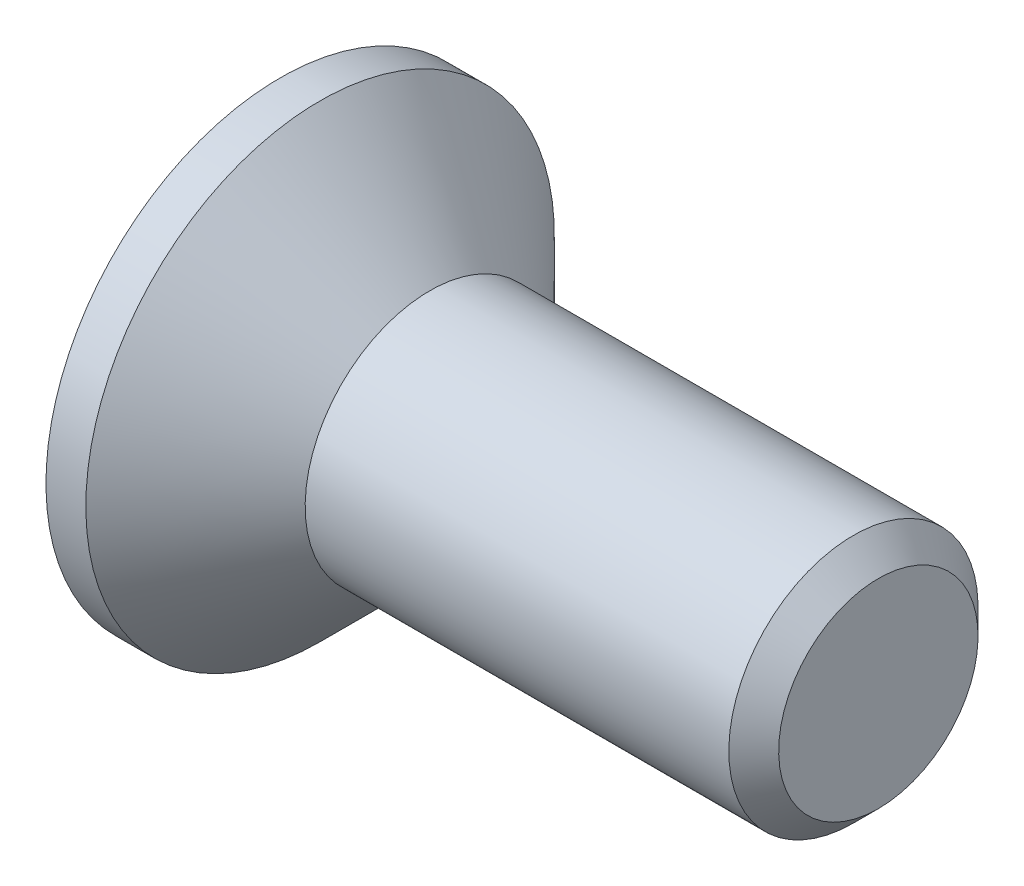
ISO-10303-21;
HEADER;
FILE_DESCRIPTION(('STEP AP214'),'2;1');
FILE_NAME('part.step','',(''),(''),'','','');
FILE_SCHEMA(('AUTOMOTIVE_DESIGN { 1 0 10303 214 1 1 1 1 }'));
ENDSEC;
DATA;
#1=APPLICATION_CONTEXT('core data for automotive mechanical design processes');
#2=APPLICATION_PROTOCOL_DEFINITION('international standard','automotive_design',2000,#1);
#3=PRODUCT_CONTEXT('',#1,'mechanical');
#4=PRODUCT('Part','Part','',(#3));
#5=PRODUCT_RELATED_PRODUCT_CATEGORY('part','',(#4));
#6=PRODUCT_DEFINITION_FORMATION('','',#4);
#7=PRODUCT_DEFINITION_CONTEXT('part definition',#1,'design');
#8=PRODUCT_DEFINITION('design','',#6,#7);
#9=PRODUCT_DEFINITION_SHAPE('','',#8);
#10=(LENGTH_UNIT() NAMED_UNIT(*) SI_UNIT(.MILLI.,.METRE.));
#11=(NAMED_UNIT(*) PLANE_ANGLE_UNIT() SI_UNIT($,.RADIAN.));
#12=(NAMED_UNIT(*) SI_UNIT($,.STERADIAN.) SOLID_ANGLE_UNIT());
#13=UNCERTAINTY_MEASURE_WITH_UNIT(LENGTH_MEASURE(1.E-05),#10,'distance_accuracy_value','');
#14=(GEOMETRIC_REPRESENTATION_CONTEXT(3) GLOBAL_UNCERTAINTY_ASSIGNED_CONTEXT((#13)) GLOBAL_UNIT_ASSIGNED_CONTEXT((#10,
#11,#12)) REPRESENTATION_CONTEXT('',''));
#15=CARTESIAN_POINT('',(0.,0.,0.));
#16=DIRECTION('',(0.,0.,1.));
#17=DIRECTION('',(1.,0.,0.));
#18=AXIS2_PLACEMENT_3D('',#15,#16,#17);
#19=CARTESIAN_POINT('',(0.,0.,0.));
#20=DIRECTION('',(-1.,0.,0.));
#21=DIRECTION('',(0.,-1.,0.));
#22=AXIS2_PLACEMENT_3D('',#19,#20,#21);
#23=CONICAL_SURFACE('',#22,1.25,0.78539816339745);
#24=CARTESIAN_POINT('',(-1.1,0.,0.));
#25=DIRECTION('',(-1.,0.,0.));
#26=DIRECTION('',(0.,-1.,0.));
#27=AXIS2_PLACEMENT_3D('',#24,#25,#26);
#28=CIRCLE('',#27,2.35);
#29=CARTESIAN_POINT('',(-1.1,-2.35,0.));
#30=VERTEX_POINT('',#29);
#31=EDGE_CURVE('E189',#30,#30,#28,.T.);
#32=ORIENTED_EDGE('',*,*,#31,.F.);
#33=EDGE_LOOP('',(#32));
#34=FACE_BOUND('',#33,.T.);
#35=CARTESIAN_POINT('',(0.,0.,0.));
#36=DIRECTION('',(-1.,0.,0.));
#37=DIRECTION('',(0.,-1.,0.));
#38=AXIS2_PLACEMENT_3D('',#35,#36,#37);
#39=CIRCLE('',#38,1.25);
#40=CARTESIAN_POINT('',(0.,-1.25,0.));
#41=VERTEX_POINT('',#40);
#42=EDGE_CURVE('E212',#41,#41,#39,.T.);
#43=ORIENTED_EDGE('',*,*,#42,.T.);
#44=EDGE_LOOP('',(#43));
#45=FACE_BOUND('',#44,.T.);
#46=ADVANCED_FACE('F33',(#34,#45),#23,.T.);
#47=CARTESIAN_POINT('',(-1.5,0.,0.));
#48=DIRECTION('',(-1.,0.,0.));
#49=DIRECTION('',(0.,-1.,0.));
#50=AXIS2_PLACEMENT_3D('',#47,#48,#49);
#51=CYLINDRICAL_SURFACE('',#50,1.25);
#52=CARTESIAN_POINT('',(4.25,0.,0.));
#53=DIRECTION('',(-1.,0.,0.));
#54=DIRECTION('',(0.,-1.,0.));
#55=AXIS2_PLACEMENT_3D('',#52,#53,#54);
#56=CIRCLE('',#55,1.25);
#57=CARTESIAN_POINT('',(4.25,-1.25,0.));
#58=VERTEX_POINT('',#57);
#59=EDGE_CURVE('E41',#58,#58,#56,.T.);
#60=ORIENTED_EDGE('',*,*,#59,.T.);
#61=EDGE_LOOP('',(#60));
#62=FACE_BOUND('',#61,.T.);
#63=ORIENTED_EDGE('',*,*,#42,.F.);
#64=EDGE_LOOP('',(#63));
#65=FACE_BOUND('',#64,.T.);
#66=ADVANCED_FACE('F217',(#62,#65),#51,.T.);
#67=CARTESIAN_POINT('',(4.5,0.,0.));
#68=DIRECTION('',(-1.,0.,0.));
#69=DIRECTION('',(0.,-1.,0.));
#70=AXIS2_PLACEMENT_3D('',#67,#68,#69);
#71=PLANE('',#70);
#72=CARTESIAN_POINT('',(4.5,0.,0.));
#73=DIRECTION('',(-1.,0.,0.));
#74=DIRECTION('',(0.,-1.,0.));
#75=AXIS2_PLACEMENT_3D('',#72,#73,#74);
#76=CIRCLE('',#75,0.999999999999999);
#77=CARTESIAN_POINT('',(4.5,-0.999999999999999,0.));
#78=VERTEX_POINT('',#77);
#79=EDGE_CURVE('E11',#78,#78,#76,.F.);
#80=ORIENTED_EDGE('',*,*,#79,.T.);
#81=EDGE_LOOP('',(#80));
#82=FACE_BOUND('',#81,.T.);
#83=ADVANCED_FACE('F239',(#82),#71,.F.);
#84=CARTESIAN_POINT('',(-1.5,2.35,0.));
#85=DIRECTION('',(1.,0.,0.));
#86=DIRECTION('',(0.,1.,0.));
#87=AXIS2_PLACEMENT_3D('',#84,#85,#86);
#88=PLANE('',#87);
#89=DIRECTION('',(0.,0.,-1.));
#90=VECTOR('',#89,1.);
#91=CARTESIAN_POINT('',(-1.5,0.34,-1.35));
#92=LINE('',#91,#90);
#93=CARTESIAN_POINT('',(-1.5,0.34,-0.34));
#94=VERTEX_POINT('',#93);
#95=CARTESIAN_POINT('',(-1.5,0.34,-1.35));
#96=VERTEX_POINT('',#95);
#97=EDGE_CURVE('E158',#94,#96,#92,.T.);
#98=ORIENTED_EDGE('',*,*,#97,.F.);
#99=DIRECTION('',(0.,-1.,0.));
#100=VECTOR('',#99,1.);
#101=CARTESIAN_POINT('',(-1.5,0.34,-0.34));
#102=LINE('',#101,#100);
#103=CARTESIAN_POINT('',(-1.5,1.35,-0.34));
#104=VERTEX_POINT('',#103);
#105=EDGE_CURVE('E48',#104,#94,#102,.T.);
#106=ORIENTED_EDGE('',*,*,#105,.F.);
#107=DIRECTION('',(0.,0.,-1.));
#108=VECTOR('',#107,1.);
#109=CARTESIAN_POINT('',(-1.5,1.35,-0.34));
#110=LINE('',#109,#108);
#111=CARTESIAN_POINT('',(-1.5,1.35,0.34));
#112=VERTEX_POINT('',#111);
#113=EDGE_CURVE('E185',#112,#104,#110,.T.);
#114=ORIENTED_EDGE('',*,*,#113,.F.);
#115=DIRECTION('',(0.,1.,0.));
#116=VECTOR('',#115,1.);
#117=CARTESIAN_POINT('',(-1.5,1.35,0.34));
#118=LINE('',#117,#116);
#119=CARTESIAN_POINT('',(-1.5,0.34,0.34));
#120=VERTEX_POINT('',#119);
#121=EDGE_CURVE('E183',#120,#112,#118,.T.);
#122=ORIENTED_EDGE('',*,*,#121,.F.);
#123=DIRECTION('',(0.,0.,-1.));
#124=VECTOR('',#123,1.);
#125=CARTESIAN_POINT('',(-1.5,0.34,0.34));
#126=LINE('',#125,#124);
#127=CARTESIAN_POINT('',(-1.5,0.34,1.35));
#128=VERTEX_POINT('',#127);
#129=EDGE_CURVE('E132',#128,#120,#126,.T.);
#130=ORIENTED_EDGE('',*,*,#129,.F.);
#131=DIRECTION('',(0.,1.,0.));
#132=VECTOR('',#131,1.);
#133=CARTESIAN_POINT('',(-1.5,0.34,1.35));
#134=LINE('',#133,#132);
#135=CARTESIAN_POINT('',(-1.5,-0.34,1.35));
#136=VERTEX_POINT('',#135);
#137=EDGE_CURVE('E179',#136,#128,#134,.T.);
#138=ORIENTED_EDGE('',*,*,#137,.F.);
#139=DIRECTION('',(0.,0.,1.));
#140=VECTOR('',#139,1.);
#141=CARTESIAN_POINT('',(-1.5,-0.34,1.35));
#142=LINE('',#141,#140);
#143=CARTESIAN_POINT('',(-1.5,-0.34,0.34));
#144=VERTEX_POINT('',#143);
#145=EDGE_CURVE('E176',#144,#136,#142,.T.);
#146=ORIENTED_EDGE('',*,*,#145,.F.);
#147=DIRECTION('',(0.,1.,0.));
#148=VECTOR('',#147,1.);
#149=CARTESIAN_POINT('',(-1.5,-0.34,0.34));
#150=LINE('',#149,#148);
#151=CARTESIAN_POINT('',(-1.5,-1.35,0.34));
#152=VERTEX_POINT('',#151);
#153=EDGE_CURVE('E173',#152,#144,#150,.T.);
#154=ORIENTED_EDGE('',*,*,#153,.F.);
#155=DIRECTION('',(0.,0.,1.));
#156=VECTOR('',#155,1.);
#157=CARTESIAN_POINT('',(-1.5,-1.35,0.34));
#158=LINE('',#157,#156);
#159=CARTESIAN_POINT('',(-1.5,-1.35,-0.34));
#160=VERTEX_POINT('',#159);
#161=EDGE_CURVE('E170',#160,#152,#158,.T.);
#162=ORIENTED_EDGE('',*,*,#161,.F.);
#163=DIRECTION('',(0.,-1.,0.));
#164=VECTOR('',#163,1.);
#165=CARTESIAN_POINT('',(-1.5,-1.35,-0.34));
#166=LINE('',#165,#164);
#167=CARTESIAN_POINT('',(-1.5,-0.34,-0.34));
#168=VERTEX_POINT('',#167);
#169=EDGE_CURVE('E167',#168,#160,#166,.T.);
#170=ORIENTED_EDGE('',*,*,#169,.F.);
#171=DIRECTION('',(0.,0.,1.));
#172=VECTOR('',#171,1.);
#173=CARTESIAN_POINT('',(-1.5,-0.34,-0.34));
#174=LINE('',#173,#172);
#175=CARTESIAN_POINT('',(-1.5,-0.34,-1.35));
#176=VERTEX_POINT('',#175);
#177=EDGE_CURVE('E164',#176,#168,#174,.T.);
#178=ORIENTED_EDGE('',*,*,#177,.F.);
#179=DIRECTION('',(0.,-1.,0.));
#180=VECTOR('',#179,1.);
#181=CARTESIAN_POINT('',(-1.5,-0.34,-1.35));
#182=LINE('',#181,#180);
#183=EDGE_CURVE('E161',#96,#176,#182,.T.);
#184=ORIENTED_EDGE('',*,*,#183,.F.);
#185=EDGE_LOOP('',(#98,#106,#114,#122,#130,#138,#146,#154,#162,#170,#178,#184));
#186=FACE_BOUND('',#185,.T.);
#187=CARTESIAN_POINT('',(-1.5,0.,0.));
#188=DIRECTION('',(-1.,0.,0.));
#189=DIRECTION('',(0.,-1.,0.));
#190=AXIS2_PLACEMENT_3D('',#187,#188,#189);
#191=CIRCLE('',#190,2.35);
#192=CARTESIAN_POINT('',(-1.5,-2.35,0.));
#193=VERTEX_POINT('',#192);
#194=EDGE_CURVE('E209',#193,#193,#191,.T.);
#195=ORIENTED_EDGE('',*,*,#194,.T.);
#196=EDGE_LOOP('',(#195));
#197=FACE_BOUND('',#196,.T.);
#198=ADVANCED_FACE('F230',(#186,#197),#88,.F.);
#199=CARTESIAN_POINT('',(-1.5,0.,0.));
#200=DIRECTION('',(-1.,0.,0.));
#201=DIRECTION('',(0.,-1.,0.));
#202=AXIS2_PLACEMENT_3D('',#199,#200,#201);
#203=CYLINDRICAL_SURFACE('',#202,2.35);
#204=ORIENTED_EDGE('',*,*,#194,.F.);
#205=EDGE_LOOP('',(#204));
#206=FACE_BOUND('',#205,.T.);
#207=ORIENTED_EDGE('',*,*,#31,.T.);
#208=EDGE_LOOP('',(#207));
#209=FACE_BOUND('',#208,.T.);
#210=ADVANCED_FACE('F222',(#206,#209),#203,.T.);
#211=CARTESIAN_POINT('',(4.25,0.,0.));
#212=DIRECTION('',(-1.,0.,0.));
#213=DIRECTION('',(0.,-1.,0.));
#214=AXIS2_PLACEMENT_3D('',#211,#212,#213);
#215=CONICAL_SURFACE('',#214,1.25,0.785398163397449);
#216=ORIENTED_EDGE('',*,*,#79,.F.);
#217=EDGE_LOOP('',(#216));
#218=FACE_BOUND('',#217,.T.);
#219=ORIENTED_EDGE('',*,*,#59,.F.);
#220=EDGE_LOOP('',(#219));
#221=FACE_BOUND('',#220,.T.);
#222=ADVANCED_FACE('F35',(#218,#221),#215,.T.);
#223=CARTESIAN_POINT('',(-0.25,0.34,-0.34));
#224=DIRECTION('',(0.,0.,-1.));
#225=DIRECTION('',(-1.,0.,0.));
#226=AXIS2_PLACEMENT_3D('',#223,#224,#225);
#227=PLANE('',#226);
#228=ORIENTED_EDGE('',*,*,#105,.T.);
#229=DIRECTION('',(-1.,0.,0.));
#230=VECTOR('',#229,1.);
#231=CARTESIAN_POINT('',(-0.25,0.34,-0.34));
#232=LINE('',#231,#230);
#233=CARTESIAN_POINT('',(-0.25,0.34,-0.34));
#234=VERTEX_POINT('',#233);
#235=EDGE_CURVE('E96',#234,#94,#232,.T.);
#236=ORIENTED_EDGE('',*,*,#235,.F.);
#237=DIRECTION('',(0.,-1.,0.));
#238=VECTOR('',#237,1.);
#239=CARTESIAN_POINT('',(-0.25,0.34,-0.34));
#240=LINE('',#239,#238);
#241=CARTESIAN_POINT('',(-0.25,1.35,-0.34));
#242=VERTEX_POINT('',#241);
#243=EDGE_CURVE('E187',#242,#234,#240,.T.);
#244=ORIENTED_EDGE('',*,*,#243,.F.);
#245=DIRECTION('',(-1.,0.,0.));
#246=VECTOR('',#245,1.);
#247=CARTESIAN_POINT('',(-0.25,1.35,-0.34));
#248=LINE('',#247,#246);
#249=EDGE_CURVE('E56',#242,#104,#248,.T.);
#250=ORIENTED_EDGE('',*,*,#249,.T.);
#251=EDGE_LOOP('',(#228,#236,#244,#250));
#252=FACE_BOUND('',#251,.T.);
#253=ADVANCED_FACE('F221',(#252),#227,.F.);
#254=CARTESIAN_POINT('',(-0.25,1.35,-0.34));
#255=DIRECTION('',(0.,1.,0.));
#256=DIRECTION('',(-1.,0.,0.));
#257=AXIS2_PLACEMENT_3D('',#254,#255,#256);
#258=PLANE('',#257);
#259=ORIENTED_EDGE('',*,*,#113,.T.);
#260=ORIENTED_EDGE('',*,*,#249,.F.);
#261=DIRECTION('',(0.,0.,-1.));
#262=VECTOR('',#261,1.);
#263=CARTESIAN_POINT('',(-0.25,1.35,-0.34));
#264=LINE('',#263,#262);
#265=CARTESIAN_POINT('',(-0.25,1.35,0.34));
#266=VERTEX_POINT('',#265);
#267=EDGE_CURVE('E144',#266,#242,#264,.T.);
#268=ORIENTED_EDGE('',*,*,#267,.F.);
#269=DIRECTION('',(-1.,0.,0.));
#270=VECTOR('',#269,1.);
#271=CARTESIAN_POINT('',(-0.25,1.35,0.34));
#272=LINE('',#271,#270);
#273=EDGE_CURVE('E136',#266,#112,#272,.T.);
#274=ORIENTED_EDGE('',*,*,#273,.T.);
#275=EDGE_LOOP('',(#259,#260,#268,#274));
#276=FACE_BOUND('',#275,.T.);
#277=ADVANCED_FACE('F228',(#276),#258,.F.);
#278=CARTESIAN_POINT('',(-0.25,1.35,0.34));
#279=DIRECTION('',(0.,0.,1.));
#280=DIRECTION('',(1.,0.,0.));
#281=AXIS2_PLACEMENT_3D('',#278,#279,#280);
#282=PLANE('',#281);
#283=ORIENTED_EDGE('',*,*,#121,.T.);
#284=ORIENTED_EDGE('',*,*,#273,.F.);
#285=DIRECTION('',(0.,1.,0.));
#286=VECTOR('',#285,1.);
#287=CARTESIAN_POINT('',(-0.25,1.35,0.34));
#288=LINE('',#287,#286);
#289=CARTESIAN_POINT('',(-0.25,0.34,0.34));
#290=VERTEX_POINT('',#289);
#291=EDGE_CURVE('E140',#290,#266,#288,.T.);
#292=ORIENTED_EDGE('',*,*,#291,.F.);
#293=DIRECTION('',(-1.,0.,0.));
#294=VECTOR('',#293,1.);
#295=CARTESIAN_POINT('',(-0.25,0.34,0.34));
#296=LINE('',#295,#294);
#297=EDGE_CURVE('E125',#290,#120,#296,.T.);
#298=ORIENTED_EDGE('',*,*,#297,.T.);
#299=EDGE_LOOP('',(#283,#284,#292,#298));
#300=FACE_BOUND('',#299,.T.);
#301=ADVANCED_FACE('F141',(#300),#282,.F.);
#302=CARTESIAN_POINT('',(-0.25,0.34,0.34));
#303=DIRECTION('',(0.,1.,0.));
#304=DIRECTION('',(-1.,0.,0.));
#305=AXIS2_PLACEMENT_3D('',#302,#303,#304);
#306=PLANE('',#305);
#307=ORIENTED_EDGE('',*,*,#129,.T.);
#308=ORIENTED_EDGE('',*,*,#297,.F.);
#309=DIRECTION('',(0.,0.,-1.));
#310=VECTOR('',#309,1.);
#311=CARTESIAN_POINT('',(-0.25,0.34,0.34));
#312=LINE('',#311,#310);
#313=CARTESIAN_POINT('',(-0.25,0.34,1.35));
#314=VERTEX_POINT('',#313);
#315=EDGE_CURVE('E129',#314,#290,#312,.T.);
#316=ORIENTED_EDGE('',*,*,#315,.F.);
#317=DIRECTION('',(-1.,0.,0.));
#318=VECTOR('',#317,1.);
#319=CARTESIAN_POINT('',(-0.25,0.34,1.35));
#320=LINE('',#319,#318);
#321=EDGE_CURVE('E137',#314,#128,#320,.T.);
#322=ORIENTED_EDGE('',*,*,#321,.T.);
#323=EDGE_LOOP('',(#307,#308,#316,#322));
#324=FACE_BOUND('',#323,.T.);
#325=ADVANCED_FACE('F127',(#324),#306,.F.);
#326=CARTESIAN_POINT('',(-0.25,0.34,1.35));
#327=DIRECTION('',(0.,0.,1.));
#328=DIRECTION('',(1.,0.,0.));
#329=AXIS2_PLACEMENT_3D('',#326,#327,#328);
#330=PLANE('',#329);
#331=ORIENTED_EDGE('',*,*,#137,.T.);
#332=ORIENTED_EDGE('',*,*,#321,.F.);
#333=DIRECTION('',(0.,1.,0.));
#334=VECTOR('',#333,1.);
#335=CARTESIAN_POINT('',(-0.25,0.34,1.35));
#336=LINE('',#335,#334);
#337=CARTESIAN_POINT('',(-0.25,-0.34,1.35));
#338=VERTEX_POINT('',#337);
#339=EDGE_CURVE('E150',#338,#314,#336,.T.);
#340=ORIENTED_EDGE('',*,*,#339,.F.);
#341=DIRECTION('',(-1.,0.,0.));
#342=VECTOR('',#341,1.);
#343=CARTESIAN_POINT('',(-0.25,-0.34,1.35));
#344=LINE('',#343,#342);
#345=EDGE_CURVE('E192',#338,#136,#344,.T.);
#346=ORIENTED_EDGE('',*,*,#345,.T.);
#347=EDGE_LOOP('',(#331,#332,#340,#346));
#348=FACE_BOUND('',#347,.T.);
#349=ADVANCED_FACE('F277',(#348),#330,.F.);
#350=CARTESIAN_POINT('',(-0.25,-0.34,1.35));
#351=DIRECTION('',(0.,-1.,0.));
#352=DIRECTION('',(1.,0.,0.));
#353=AXIS2_PLACEMENT_3D('',#350,#351,#352);
#354=PLANE('',#353);
#355=ORIENTED_EDGE('',*,*,#145,.T.);
#356=ORIENTED_EDGE('',*,*,#345,.F.);
#357=DIRECTION('',(0.,0.,1.));
#358=VECTOR('',#357,1.);
#359=CARTESIAN_POINT('',(-0.25,-0.34,1.35));
#360=LINE('',#359,#358);
#361=CARTESIAN_POINT('',(-0.25,-0.34,0.34));
#362=VERTEX_POINT('',#361);
#363=EDGE_CURVE('E152',#362,#338,#360,.T.);
#364=ORIENTED_EDGE('',*,*,#363,.F.);
#365=DIRECTION('',(-1.,0.,0.));
#366=VECTOR('',#365,1.);
#367=CARTESIAN_POINT('',(-0.25,-0.34,0.34));
#368=LINE('',#367,#366);
#369=EDGE_CURVE('E194',#362,#144,#368,.T.);
#370=ORIENTED_EDGE('',*,*,#369,.T.);
#371=EDGE_LOOP('',(#355,#356,#364,#370));
#372=FACE_BOUND('',#371,.T.);
#373=ADVANCED_FACE('F273',(#372),#354,.F.);
#374=CARTESIAN_POINT('',(-0.25,-0.34,0.34));
#375=DIRECTION('',(0.,0.,1.));
#376=DIRECTION('',(1.,0.,0.));
#377=AXIS2_PLACEMENT_3D('',#374,#375,#376);
#378=PLANE('',#377);
#379=ORIENTED_EDGE('',*,*,#153,.T.);
#380=ORIENTED_EDGE('',*,*,#369,.F.);
#381=DIRECTION('',(0.,1.,0.));
#382=VECTOR('',#381,1.);
#383=CARTESIAN_POINT('',(-0.25,-0.34,0.34));
#384=LINE('',#383,#382);
#385=CARTESIAN_POINT('',(-0.25,-1.35,0.34));
#386=VERTEX_POINT('',#385);
#387=EDGE_CURVE('E422',#386,#362,#384,.T.);
#388=ORIENTED_EDGE('',*,*,#387,.F.);
#389=DIRECTION('',(-1.,0.,0.));
#390=VECTOR('',#389,1.);
#391=CARTESIAN_POINT('',(-0.25,-1.35,0.34));
#392=LINE('',#391,#390);
#393=EDGE_CURVE('E196',#386,#152,#392,.T.);
#394=ORIENTED_EDGE('',*,*,#393,.T.);
#395=EDGE_LOOP('',(#379,#380,#388,#394));
#396=FACE_BOUND('',#395,.T.);
#397=ADVANCED_FACE('F269',(#396),#378,.F.);
#398=CARTESIAN_POINT('',(-0.25,-1.35,0.34));
#399=DIRECTION('',(0.,-1.,0.));
#400=DIRECTION('',(1.,0.,0.));
#401=AXIS2_PLACEMENT_3D('',#398,#399,#400);
#402=PLANE('',#401);
#403=ORIENTED_EDGE('',*,*,#161,.T.);
#404=ORIENTED_EDGE('',*,*,#393,.F.);
#405=DIRECTION('',(0.,0.,1.));
#406=VECTOR('',#405,1.);
#407=CARTESIAN_POINT('',(-0.25,-1.35,0.34));
#408=LINE('',#407,#406);
#409=CARTESIAN_POINT('',(-0.25,-1.35,-0.34));
#410=VERTEX_POINT('',#409);
#411=EDGE_CURVE('E419',#410,#386,#408,.T.);
#412=ORIENTED_EDGE('',*,*,#411,.F.);
#413=DIRECTION('',(-1.,0.,0.));
#414=VECTOR('',#413,1.);
#415=CARTESIAN_POINT('',(-0.25,-1.35,-0.34));
#416=LINE('',#415,#414);
#417=EDGE_CURVE('E198',#410,#160,#416,.T.);
#418=ORIENTED_EDGE('',*,*,#417,.T.);
#419=EDGE_LOOP('',(#403,#404,#412,#418));
#420=FACE_BOUND('',#419,.T.);
#421=ADVANCED_FACE('F265',(#420),#402,.F.);
#422=CARTESIAN_POINT('',(-0.25,-1.35,-0.34));
#423=DIRECTION('',(0.,0.,-1.));
#424=DIRECTION('',(-1.,0.,0.));
#425=AXIS2_PLACEMENT_3D('',#422,#423,#424);
#426=PLANE('',#425);
#427=ORIENTED_EDGE('',*,*,#169,.T.);
#428=ORIENTED_EDGE('',*,*,#417,.F.);
#429=DIRECTION('',(0.,-1.,0.));
#430=VECTOR('',#429,1.);
#431=CARTESIAN_POINT('',(-0.25,-1.35,-0.34));
#432=LINE('',#431,#430);
#433=CARTESIAN_POINT('',(-0.25,-0.34,-0.34));
#434=VERTEX_POINT('',#433);
#435=EDGE_CURVE('E416',#434,#410,#432,.T.);
#436=ORIENTED_EDGE('',*,*,#435,.F.);
#437=DIRECTION('',(-1.,0.,0.));
#438=VECTOR('',#437,1.);
#439=CARTESIAN_POINT('',(-0.25,-0.34,-0.34));
#440=LINE('',#439,#438);
#441=EDGE_CURVE('E200',#434,#168,#440,.T.);
#442=ORIENTED_EDGE('',*,*,#441,.T.);
#443=EDGE_LOOP('',(#427,#428,#436,#442));
#444=FACE_BOUND('',#443,.T.);
#445=ADVANCED_FACE('F261',(#444),#426,.F.);
#446=CARTESIAN_POINT('',(-0.25,-0.34,-0.34));
#447=DIRECTION('',(0.,-1.,0.));
#448=DIRECTION('',(1.,0.,0.));
#449=AXIS2_PLACEMENT_3D('',#446,#447,#448);
#450=PLANE('',#449);
#451=ORIENTED_EDGE('',*,*,#177,.T.);
#452=ORIENTED_EDGE('',*,*,#441,.F.);
#453=DIRECTION('',(0.,0.,1.));
#454=VECTOR('',#453,1.);
#455=CARTESIAN_POINT('',(-0.25,-0.34,-0.34));
#456=LINE('',#455,#454);
#457=CARTESIAN_POINT('',(-0.25,-0.34,-1.35));
#458=VERTEX_POINT('',#457);
#459=EDGE_CURVE('E413',#458,#434,#456,.T.);
#460=ORIENTED_EDGE('',*,*,#459,.F.);
#461=DIRECTION('',(-1.,0.,0.));
#462=VECTOR('',#461,1.);
#463=CARTESIAN_POINT('',(-0.25,-0.34,-1.35));
#464=LINE('',#463,#462);
#465=EDGE_CURVE('E202',#458,#176,#464,.T.);
#466=ORIENTED_EDGE('',*,*,#465,.T.);
#467=EDGE_LOOP('',(#451,#452,#460,#466));
#468=FACE_BOUND('',#467,.T.);
#469=ADVANCED_FACE('F257',(#468),#450,.F.);
#470=CARTESIAN_POINT('',(-0.25,-0.34,-1.35));
#471=DIRECTION('',(0.,0.,-1.));
#472=DIRECTION('',(-1.,0.,0.));
#473=AXIS2_PLACEMENT_3D('',#470,#471,#472);
#474=PLANE('',#473);
#475=ORIENTED_EDGE('',*,*,#183,.T.);
#476=ORIENTED_EDGE('',*,*,#465,.F.);
#477=DIRECTION('',(0.,-1.,0.));
#478=VECTOR('',#477,1.);
#479=CARTESIAN_POINT('',(-0.25,-0.34,-1.35));
#480=LINE('',#479,#478);
#481=CARTESIAN_POINT('',(-0.25,0.34,-1.35));
#482=VERTEX_POINT('',#481);
#483=EDGE_CURVE('E408',#482,#458,#480,.T.);
#484=ORIENTED_EDGE('',*,*,#483,.F.);
#485=DIRECTION('',(-1.,0.,0.));
#486=VECTOR('',#485,1.);
#487=CARTESIAN_POINT('',(-0.25,0.34,-1.35));
#488=LINE('',#487,#486);
#489=EDGE_CURVE('E204',#482,#96,#488,.T.);
#490=ORIENTED_EDGE('',*,*,#489,.T.);
#491=EDGE_LOOP('',(#475,#476,#484,#490));
#492=FACE_BOUND('',#491,.T.);
#493=ADVANCED_FACE('F253',(#492),#474,.F.);
#494=CARTESIAN_POINT('',(-0.25,0.34,-1.35));
#495=DIRECTION('',(0.,1.,0.));
#496=DIRECTION('',(-1.,0.,0.));
#497=AXIS2_PLACEMENT_3D('',#494,#495,#496);
#498=PLANE('',#497);
#499=ORIENTED_EDGE('',*,*,#97,.T.);
#500=ORIENTED_EDGE('',*,*,#489,.F.);
#501=DIRECTION('',(0.,0.,-1.));
#502=VECTOR('',#501,1.);
#503=CARTESIAN_POINT('',(-0.25,0.34,-1.35));
#504=LINE('',#503,#502);
#505=EDGE_CURVE('E406',#234,#482,#504,.T.);
#506=ORIENTED_EDGE('',*,*,#505,.F.);
#507=ORIENTED_EDGE('',*,*,#235,.T.);
#508=EDGE_LOOP('',(#499,#500,#506,#507));
#509=FACE_BOUND('',#508,.T.);
#510=ADVANCED_FACE('F250',(#509),#498,.F.);
#511=CARTESIAN_POINT('',(-0.25,0.,0.));
#512=DIRECTION('',(1.,0.,0.));
#513=DIRECTION('',(0.,0.,-1.));
#514=AXIS2_PLACEMENT_3D('',#511,#512,#513);
#515=PLANE('',#514);
#516=ORIENTED_EDGE('',*,*,#243,.T.);
#517=ORIENTED_EDGE('',*,*,#505,.T.);
#518=ORIENTED_EDGE('',*,*,#483,.T.);
#519=ORIENTED_EDGE('',*,*,#459,.T.);
#520=ORIENTED_EDGE('',*,*,#435,.T.);
#521=ORIENTED_EDGE('',*,*,#411,.T.);
#522=ORIENTED_EDGE('',*,*,#387,.T.);
#523=ORIENTED_EDGE('',*,*,#363,.T.);
#524=ORIENTED_EDGE('',*,*,#339,.T.);
#525=ORIENTED_EDGE('',*,*,#315,.T.);
#526=ORIENTED_EDGE('',*,*,#291,.T.);
#527=ORIENTED_EDGE('',*,*,#267,.T.);
#528=EDGE_LOOP('',(#516,#517,#518,#519,#520,#521,#522,#523,#524,#525,#526,#527));
#529=FACE_BOUND('',#528,.T.);
#530=ADVANCED_FACE('F147',(#529),#515,.F.);
#531=CLOSED_SHELL('',(#46,#66,#83,#198,#210,#222,#253,#277,#301,#325,#349,#373,#397,#421,#445,
#469,#493,#510,#530));
#532=MANIFOLD_SOLID_BREP('B2',#531);
#533=ADVANCED_BREP_SHAPE_REPRESENTATION('',(#18,#532),#14);
#534=SHAPE_DEFINITION_REPRESENTATION(#9,#533);
ENDSEC;
END-ISO-10303-21;
